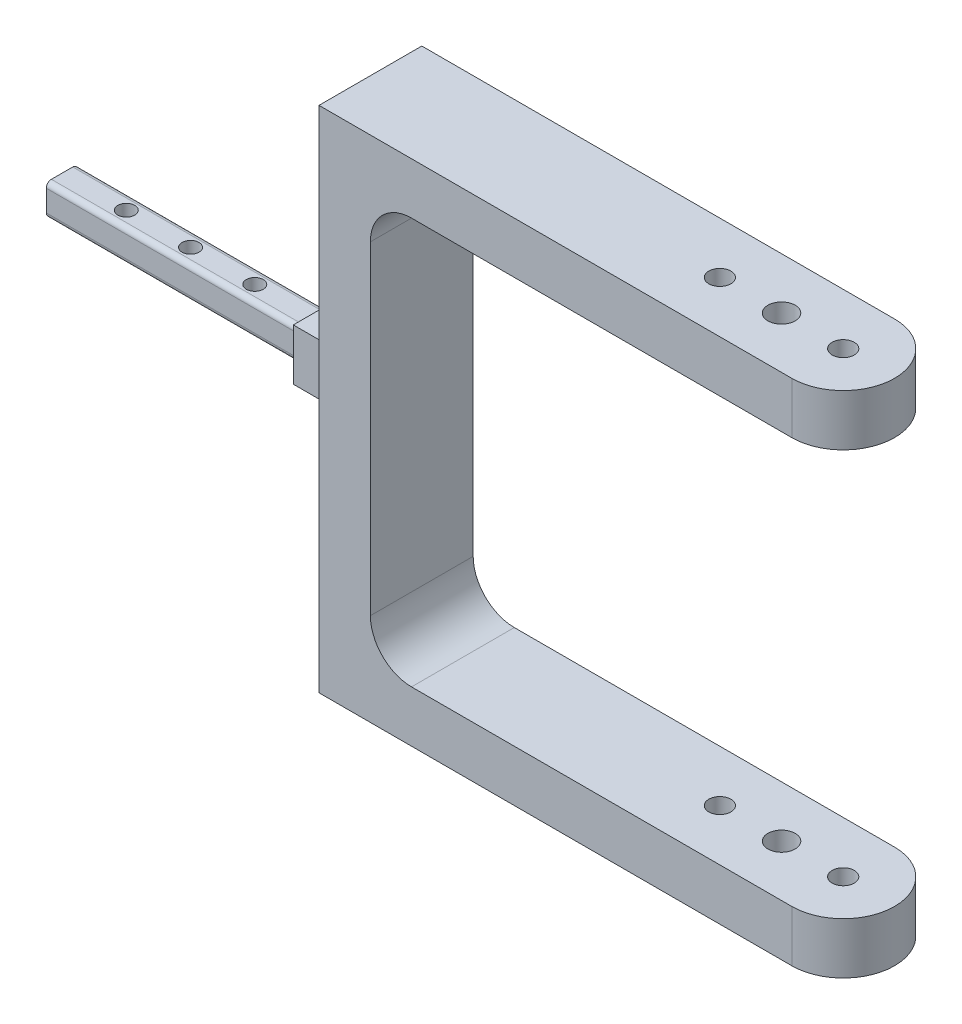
from build123d import *

# Parameters (mm, degrees)
EXTRUDE_1_DEPTH     = 20
SKETCH_3_W          = 10
SKETCH_3_H          = 10
SKETCH_3_W_2        = 6.15
SKETCH_3_H_2        = 6.15
EXTRUDE_2_DEPTH     = 10
EXTRUDE_START       = 10
SKETCH_3_3_W        = 6.15
SKETCH_3_3_H        = 6.15
EXTRUDE_3_DEPTH     = 50
SKETCH_4_W          = 20
SKETCH_4_H          = 10
EXTRUDE_4_DEPTH     = 12
SKETCH_2_R          = 2.15
SKETCH_2_R_2        = 2.65
CUT_EXTRUDE_1_DEPTH = 137.619910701
SKETCH_5_R          = 1.65
CUT_EXTRUDE_2_DEPTH = 108.833810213
FILLET_1_R          = 1
FILLET_2_R          = 8


with BuildPart() as part:
    # Sketch 1 → Extrude 1 (new body)
    with BuildSketch(Plane.XY):
        Polygon((0, 39.5), (0, -39.5), (80, -39.5), (80, -49.5), (-10, -49.5), (-10, 49.5), (80, 49.5), (80, 39.5), align=None)
    extrude(amount=EXTRUDE_1_DEPTH)

    # Sketch 3 → Extrude 2 (add)
    # profile 1 of 2: a face of its own
    with BuildSketch(Plane.ZY.offset(10)):
        with Locations((10, 0)):
            Rectangle(SKETCH_3_W, SKETCH_3_H)
        with Locations((10, 0)):
            Rectangle(SKETCH_3_W_2, SKETCH_3_H_2, mode=Mode.SUBTRACT)
    # profile 2 of 2: a face of its own
    with BuildSketch(Plane.ZY.offset(10)):
        with Locations((10, 0)):
            Rectangle(SKETCH_3_W_2, SKETCH_3_H_2)
    extrude(amount=EXTRUDE_2_DEPTH)

    # Sketch 3_3 → Extrude 3 (add)
    with BuildSketch(Plane.ZY.offset(10).offset(EXTRUDE_START)):
        with Locations((10, 0)):
            Rectangle(SKETCH_3_3_W, SKETCH_3_3_H)
    extrude(amount=EXTRUDE_3_DEPTH)

    # Sketch 4 → Extrude 4 (add)
    with BuildSketch(Plane(origin=(80, 0, 0), x_dir=(0, 0, -1), z_dir=(1, 0, 0))):
        with Locations((-10, -44.5)):
            Rectangle(SKETCH_4_W, SKETCH_4_H)
        with Locations((-10, 44.5)):
            Rectangle(SKETCH_4_W, SKETCH_4_H)
    extrude(amount=EXTRUDE_4_DEPTH)

    # Sketch 2 → Cut-Extrude 1 (cut, through all)
    with BuildSketch(Plane(origin=(0, 49.5, 0), x_dir=(1, 0, 0), z_dir=(0, 1, 0))):
        with Locations(Location((82, -10, 0), (0, 0, 180))):
            Circle(SKETCH_2_R)
        with BuildLine():
            Line((92, -20), (92, -10))
            ThreePointArc((92, -10), (89.071067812, -17.071067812), (82, -20))
            Line((82, -20), (92, -20))
        make_face()
        with BuildLine():
            ThreePointArc((82, 0), (89.071067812, -2.928932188), (92, -10))
            Line((92, -10), (92, 0))
            Line((92, 0), (82, 0))
        make_face()
        with Locations(Location((70, -10, 0), (0, 0, 180))):
            Circle(SKETCH_2_R_2)
        with Locations(Location((58, -10, 0), (0, 0, 180))):
            Circle(SKETCH_2_R)
    extrude(amount=-CUT_EXTRUDE_1_DEPTH, mode=Mode.SUBTRACT)

    # Sketch 5 → Cut-Extrude 2 (cut, through all)
    with BuildSketch(Plane(origin=(0, 3.075, 0), x_dir=(1, 0, 0), z_dir=(0, 1, 0))):
        with Locations(Location((-45, -10, 0), (0, 0, 180))):
            Circle(SKETCH_5_R)
        with Locations(Location((-32.5, -10, 0), (0, 0, 180))):
            Circle(SKETCH_5_R)
        with Locations(Location((-57.5, -10, 0), (0, 0, 180))):
            Circle(SKETCH_5_R)
    extrude(amount=-CUT_EXTRUDE_2_DEPTH, mode=Mode.SUBTRACT)

    # Fillet 1
    fillet_1_edges = [part.edges().sort_by_distance(p)[0] for p in [
        (-45, -3.075, 6.925),
        (-45, -3.075, 13.075),
        (-45, 3.075, 13.075),
        (-45, 3.075, 6.925),
    ]]
    fillet(fillet_1_edges, radius=FILLET_1_R)

    # Fillet 2
    fillet_2_edges = [part.edges().sort_by_distance(p)[0] for p in [
        (0, 39.5, 10),
        (0, -39.5, 10),
    ]]
    fillet(fillet_2_edges, radius=FILLET_2_R)


solid = part.part
